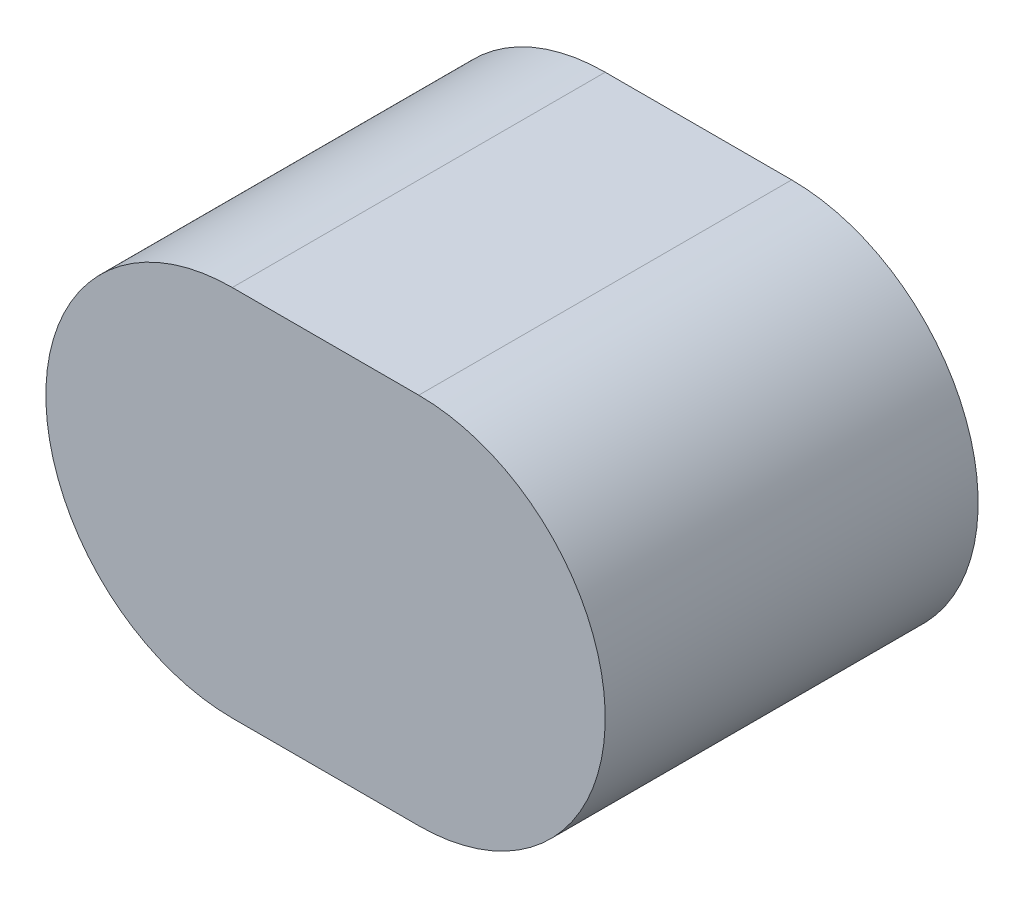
ISO-10303-21;
HEADER;
FILE_DESCRIPTION(('STEP AP214'),'2;1');
FILE_NAME('part.step','',(''),(''),'','','');
FILE_SCHEMA(('AUTOMOTIVE_DESIGN { 1 0 10303 214 1 1 1 1 }'));
ENDSEC;
DATA;
#1=APPLICATION_CONTEXT('core data for automotive mechanical design processes');
#2=APPLICATION_PROTOCOL_DEFINITION('international standard','automotive_design',2000,#1);
#3=PRODUCT_CONTEXT('',#1,'mechanical');
#4=PRODUCT('Part','Part','',(#3));
#5=PRODUCT_RELATED_PRODUCT_CATEGORY('part','',(#4));
#6=PRODUCT_DEFINITION_FORMATION('','',#4);
#7=PRODUCT_DEFINITION_CONTEXT('part definition',#1,'design');
#8=PRODUCT_DEFINITION('design','',#6,#7);
#9=PRODUCT_DEFINITION_SHAPE('','',#8);
#10=(LENGTH_UNIT() NAMED_UNIT(*) SI_UNIT(.MILLI.,.METRE.));
#11=(NAMED_UNIT(*) PLANE_ANGLE_UNIT() SI_UNIT($,.RADIAN.));
#12=(NAMED_UNIT(*) SI_UNIT($,.STERADIAN.) SOLID_ANGLE_UNIT());
#13=UNCERTAINTY_MEASURE_WITH_UNIT(LENGTH_MEASURE(1.E-05),#10,'distance_accuracy_value','');
#14=(GEOMETRIC_REPRESENTATION_CONTEXT(3) GLOBAL_UNCERTAINTY_ASSIGNED_CONTEXT((#13)) GLOBAL_UNIT_ASSIGNED_CONTEXT((#10,
#11,#12)) REPRESENTATION_CONTEXT('',''));
#15=CARTESIAN_POINT('',(0.,0.,0.));
#16=DIRECTION('',(0.,0.,1.));
#17=DIRECTION('',(1.,0.,0.));
#18=AXIS2_PLACEMENT_3D('',#15,#16,#17);
#19=CARTESIAN_POINT('',(-2.,0.,4.));
#20=DIRECTION('',(0.,0.,-1.));
#21=DIRECTION('',(-1.,0.,0.));
#22=AXIS2_PLACEMENT_3D('',#19,#20,#21);
#23=CYLINDRICAL_SURFACE('',#22,2.);
#24=CARTESIAN_POINT('',(-2.,0.,0.));
#25=DIRECTION('',(0.,0.,1.));
#26=DIRECTION('',(1.,0.,0.));
#27=AXIS2_PLACEMENT_3D('',#24,#25,#26);
#28=CIRCLE('',#27,2.);
#29=CARTESIAN_POINT('',(-2.,2.,0.));
#30=VERTEX_POINT('',#29);
#31=CARTESIAN_POINT('',(-2.,-2.,0.));
#32=VERTEX_POINT('',#31);
#33=EDGE_CURVE('E394',#30,#32,#28,.T.);
#34=ORIENTED_EDGE('',*,*,#33,.T.);
#35=DIRECTION('',(0.,0.,-1.));
#36=VECTOR('',#35,1.);
#37=CARTESIAN_POINT('',(-2.,-2.,4.));
#38=LINE('',#37,#36);
#39=CARTESIAN_POINT('',(-2.,-2.,4.));
#40=VERTEX_POINT('',#39);
#41=EDGE_CURVE('E11',#40,#32,#38,.T.);
#42=ORIENTED_EDGE('',*,*,#41,.F.);
#43=CARTESIAN_POINT('',(-2.,0.,4.));
#44=DIRECTION('',(0.,0.,1.));
#45=DIRECTION('',(1.,0.,0.));
#46=AXIS2_PLACEMENT_3D('',#43,#44,#45);
#47=CIRCLE('',#46,2.);
#48=CARTESIAN_POINT('',(-2.,2.,4.));
#49=VERTEX_POINT('',#48);
#50=EDGE_CURVE('E412',#49,#40,#47,.T.);
#51=ORIENTED_EDGE('',*,*,#50,.F.);
#52=DIRECTION('',(0.,0.,-1.));
#53=VECTOR('',#52,1.);
#54=CARTESIAN_POINT('',(-2.,2.,4.));
#55=LINE('',#54,#53);
#56=EDGE_CURVE('E406',#49,#30,#55,.T.);
#57=ORIENTED_EDGE('',*,*,#56,.T.);
#58=EDGE_LOOP('',(#34,#42,#51,#57));
#59=FACE_BOUND('',#58,.T.);
#60=ADVANCED_FACE('F350',(#59),#23,.T.);
#61=CARTESIAN_POINT('',(-2.,-2.,4.));
#62=DIRECTION('',(0.,1.,0.));
#63=DIRECTION('',(0.,0.,1.));
#64=AXIS2_PLACEMENT_3D('',#61,#62,#63);
#65=PLANE('',#64);
#66=DIRECTION('',(1.,0.,0.));
#67=VECTOR('',#66,1.);
#68=CARTESIAN_POINT('',(-2.,-2.,0.));
#69=LINE('',#68,#67);
#70=CARTESIAN_POINT('',(0.,-2.,0.));
#71=VERTEX_POINT('',#70);
#72=EDGE_CURVE('E390',#32,#71,#69,.T.);
#73=ORIENTED_EDGE('',*,*,#72,.T.);
#74=DIRECTION('',(0.,0.,-1.));
#75=VECTOR('',#74,1.);
#76=CARTESIAN_POINT('',(0.,-2.,4.));
#77=LINE('',#76,#75);
#78=CARTESIAN_POINT('',(0.,-2.,4.));
#79=VERTEX_POINT('',#78);
#80=EDGE_CURVE('E357',#79,#71,#77,.T.);
#81=ORIENTED_EDGE('',*,*,#80,.F.);
#82=DIRECTION('',(1.,0.,0.));
#83=VECTOR('',#82,1.);
#84=CARTESIAN_POINT('',(-2.,-2.,4.));
#85=LINE('',#84,#83);
#86=EDGE_CURVE('E402',#40,#79,#85,.T.);
#87=ORIENTED_EDGE('',*,*,#86,.F.);
#88=ORIENTED_EDGE('',*,*,#41,.T.);
#89=EDGE_LOOP('',(#73,#81,#87,#88));
#90=FACE_BOUND('',#89,.T.);
#91=ADVANCED_FACE('F401',(#90),#65,.F.);
#92=CARTESIAN_POINT('',(0.,0.,4.));
#93=DIRECTION('',(0.,0.,-1.));
#94=DIRECTION('',(-1.,0.,0.));
#95=AXIS2_PLACEMENT_3D('',#92,#93,#94);
#96=CYLINDRICAL_SURFACE('',#95,2.);
#97=CARTESIAN_POINT('',(0.,0.,0.));
#98=DIRECTION('',(0.,0.,1.));
#99=DIRECTION('',(1.,0.,0.));
#100=AXIS2_PLACEMENT_3D('',#97,#98,#99);
#101=CIRCLE('',#100,2.);
#102=CARTESIAN_POINT('',(0.,2.,0.));
#103=VERTEX_POINT('',#102);
#104=EDGE_CURVE('E395',#71,#103,#101,.T.);
#105=ORIENTED_EDGE('',*,*,#104,.T.);
#106=DIRECTION('',(0.,0.,-1.));
#107=VECTOR('',#106,1.);
#108=CARTESIAN_POINT('',(0.,2.,4.));
#109=LINE('',#108,#107);
#110=CARTESIAN_POINT('',(0.,2.,4.));
#111=VERTEX_POINT('',#110);
#112=EDGE_CURVE('E418',#111,#103,#109,.T.);
#113=ORIENTED_EDGE('',*,*,#112,.F.);
#114=CARTESIAN_POINT('',(0.,0.,4.));
#115=DIRECTION('',(0.,0.,1.));
#116=DIRECTION('',(1.,0.,0.));
#117=AXIS2_PLACEMENT_3D('',#114,#115,#116);
#118=CIRCLE('',#117,2.);
#119=EDGE_CURVE('E369',#79,#111,#118,.T.);
#120=ORIENTED_EDGE('',*,*,#119,.F.);
#121=ORIENTED_EDGE('',*,*,#80,.T.);
#122=EDGE_LOOP('',(#105,#113,#120,#121));
#123=FACE_BOUND('',#122,.T.);
#124=ADVANCED_FACE('F421',(#123),#96,.T.);
#125=CARTESIAN_POINT('',(0.,2.,4.));
#126=DIRECTION('',(0.,-1.,0.));
#127=DIRECTION('',(0.,0.,-1.));
#128=AXIS2_PLACEMENT_3D('',#125,#126,#127);
#129=PLANE('',#128);
#130=DIRECTION('',(-1.,0.,0.));
#131=VECTOR('',#130,1.);
#132=CARTESIAN_POINT('',(0.,2.,0.));
#133=LINE('',#132,#131);
#134=EDGE_CURVE('E410',#103,#30,#133,.T.);
#135=ORIENTED_EDGE('',*,*,#134,.T.);
#136=ORIENTED_EDGE('',*,*,#56,.F.);
#137=DIRECTION('',(-1.,0.,0.));
#138=VECTOR('',#137,1.);
#139=CARTESIAN_POINT('',(0.,2.,4.));
#140=LINE('',#139,#138);
#141=EDGE_CURVE('E364',#111,#49,#140,.T.);
#142=ORIENTED_EDGE('',*,*,#141,.F.);
#143=ORIENTED_EDGE('',*,*,#112,.T.);
#144=EDGE_LOOP('',(#135,#136,#142,#143));
#145=FACE_BOUND('',#144,.T.);
#146=ADVANCED_FACE('F423',(#145),#129,.F.);
#147=CARTESIAN_POINT('',(-2.,0.,4.));
#148=DIRECTION('',(0.,0.,1.));
#149=DIRECTION('',(1.,0.,0.));
#150=AXIS2_PLACEMENT_3D('',#147,#148,#149);
#151=PLANE('',#150);
#152=ORIENTED_EDGE('',*,*,#50,.T.);
#153=ORIENTED_EDGE('',*,*,#86,.T.);
#154=ORIENTED_EDGE('',*,*,#119,.T.);
#155=ORIENTED_EDGE('',*,*,#141,.T.);
#156=EDGE_LOOP('',(#152,#153,#154,#155));
#157=FACE_BOUND('',#156,.T.);
#158=ADVANCED_FACE('F424',(#157),#151,.T.);
#159=CARTESIAN_POINT('',(-2.,0.,0.));
#160=DIRECTION('',(0.,0.,1.));
#161=DIRECTION('',(1.,0.,0.));
#162=AXIS2_PLACEMENT_3D('',#159,#160,#161);
#163=PLANE('',#162);
#164=ORIENTED_EDGE('',*,*,#33,.F.);
#165=ORIENTED_EDGE('',*,*,#134,.F.);
#166=ORIENTED_EDGE('',*,*,#104,.F.);
#167=ORIENTED_EDGE('',*,*,#72,.F.);
#168=EDGE_LOOP('',(#164,#165,#166,#167));
#169=FACE_BOUND('',#168,.T.);
#170=ADVANCED_FACE('F391',(#169),#163,.F.);
#171=CLOSED_SHELL('',(#60,#91,#124,#146,#158,#170));
#172=MANIFOLD_SOLID_BREP('B2',#171);
#173=ADVANCED_BREP_SHAPE_REPRESENTATION('',(#18,#172),#14);
#174=SHAPE_DEFINITION_REPRESENTATION(#9,#173);
ENDSEC;
END-ISO-10303-21;
